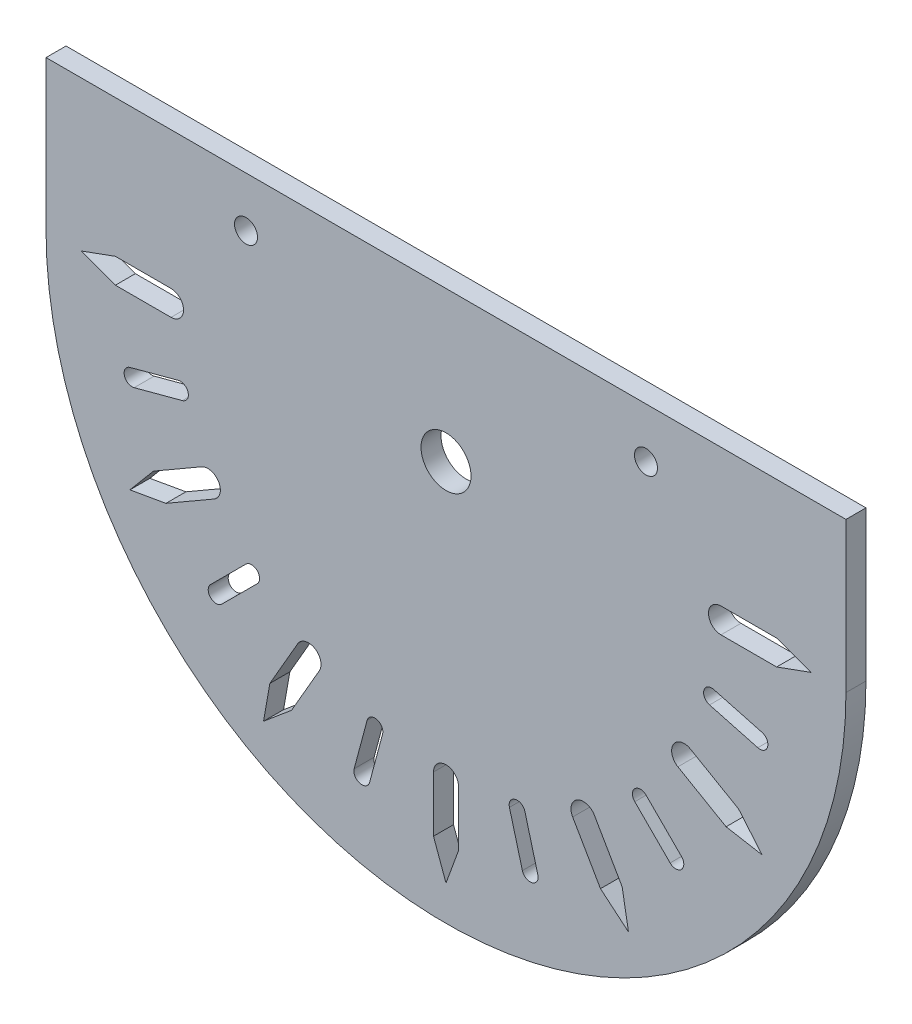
from build123d import *

# Parameters (mm, degrees)
BOSS_EXTRUDE1_DEPTH = 2
CUT_EXTRUDE2_DEPTH  = 2
CIRPATTERN1_COUNT   = 7
CIRPATTERN1_ANGLE   = 180
CUT_EXTRUDE3_DEPTH  = 2
CIRPATTERN2_COUNT   = 6
CIRPATTERN2_ANGLE   = 150
SKETCH5_R           = 2.5
CUT_EXTRUDE4_DEPTH  = 2
SKETCH6_R           = 1.15
CUT_EXTRUDE5_DEPTH  = 2


with BuildPart() as part:
    # Sketch1 → Boss-Extrude1 (new body)
    # profile 1 of 2: a face of its own
    with BuildSketch(Plane.XY):
        with BuildLine():
            ThreePointArc((40, 0), (0, -40), (-40, 0))
            Line((-40, 0), (-40, 15))
            Line((-40, 15), (40, 15))
            Line((40, 15), (40, 0))
        make_face()
        with BuildLine():
            ThreePointArc((-27.5, -1.25), (-26.25, 0), (-27.5, 1.25))
            Line((-27.5, 1.25), (-33.065653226, 1.25))
            Line((-33.065653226, 1.25), (-36.5, 0))
            Line((-36.5, 0), (-33.065653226, -1.25))
            Line((-33.065653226, -1.25), (-27.5, -1.25))
        make_face(mode=Mode.SUBTRACT)
    # profile 2 of 2: a face of its own
    with BuildSketch(Plane.XY):
        with BuildLine():
            Line((-33.065653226, -1.25), (-27.5, -1.25))
            ThreePointArc((-27.5, -1.25), (-26.25, 0), (-27.5, 1.25))
            Line((-27.5, 1.25), (-33.065653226, 1.25))
            Line((-33.065653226, 1.25), (-36.5, 0))
            Line((-36.5, 0), (-33.065653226, -1.25))
        make_face()
    extrude(amount=BOSS_EXTRUDE1_DEPTH)

    # Sketch2 → Cut-Extrude2 (cut)
    with BuildSketch(Plane.XY.offset(2)):
        with BuildLine():
            Line((-33.065653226, -1.25), (-27.5, -1.25))
            ThreePointArc((-27.5, -1.25), (-26.25, 0), (-27.5, 1.25))
            Line((-27.5, 1.25), (-33.065653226, 1.25))
            Line((-33.065653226, 1.25), (-36.5, 0))
            Line((-36.5, 0), (-33.065653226, -1.25))
        make_face()
    cut_extrude2 = extrude(amount=-CUT_EXTRUDE2_DEPTH, mode=Mode.SUBTRACT)

    # CirPattern1: Cut-Extrude2 ×7 about axis
    cirpattern1_axis = Axis((0, 0, 0), (0, 0, 1))
    for i in range(1, CIRPATTERN1_COUNT):
        add(cut_extrude2.rotate(cirpattern1_axis, i * CIRPATTERN1_ANGLE / (CIRPATTERN1_COUNT - 1)), mode=Mode.SUBTRACT)

    # Sketch4 → Cut-Extrude3 (cut)
    with BuildSketch(Plane.XY.offset(2)):
        with BuildLine():
            Line((-26.355904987, -7.890264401), (-31.185534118, -9.184359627))
            ThreePointArc((-31.185534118, -9.184359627), (-32.165330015, -8.618674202), (-31.59964459, -7.638878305))
            Line((-31.59964459, -7.638878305), (-26.770015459, -6.344783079))
            ThreePointArc((-26.770015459, -6.344783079), (-25.790219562, -6.910468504), (-26.355904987, -7.890264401))
        make_face()
    cut_extrude3 = extrude(amount=-CUT_EXTRUDE3_DEPTH, mode=Mode.SUBTRACT)

    # CirPattern2: Cut-Extrude3 ×6 about axis
    cirpattern2_axis = Axis((0, 0, 0), (0, 0, 1))
    for i in range(1, CIRPATTERN2_COUNT):
        add(cut_extrude3.rotate(cirpattern2_axis, i * CIRPATTERN2_ANGLE / (CIRPATTERN2_COUNT - 1)), mode=Mode.SUBTRACT)

    # Sketch5 → Cut-Extrude4 (cut)
    with BuildSketch(Plane.XY.offset(2)):
        Circle(SKETCH5_R)
    extrude(amount=-CUT_EXTRUDE4_DEPTH, mode=Mode.SUBTRACT)

    # Sketch6 → Cut-Extrude5 (cut)
    with BuildSketch(Plane.XY.offset(2)):
        with Locations((-20, 10)):
            Circle(SKETCH6_R)
        with Locations((20, 10)):
            Circle(SKETCH6_R)
    extrude(amount=-CUT_EXTRUDE5_DEPTH, mode=Mode.SUBTRACT)


solid = part.part
